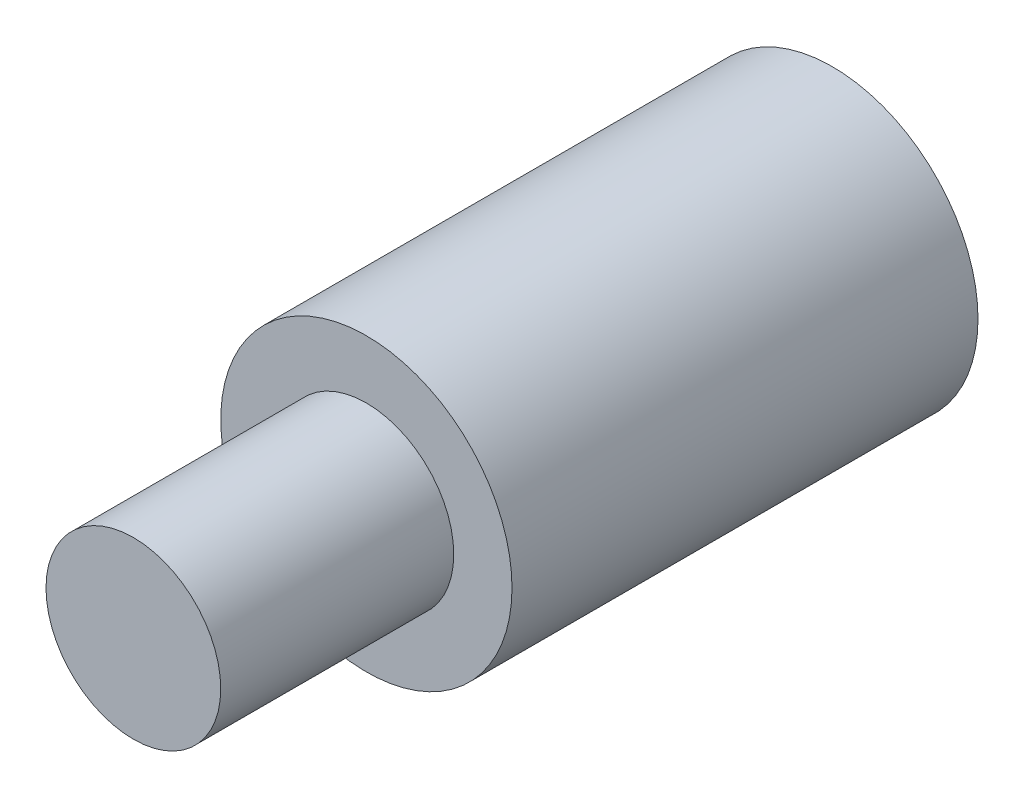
ISO-10303-21;
HEADER;
FILE_DESCRIPTION(('STEP AP214'),'2;1');
FILE_NAME('part.step','',(''),(''),'','','');
FILE_SCHEMA(('AUTOMOTIVE_DESIGN { 1 0 10303 214 1 1 1 1 }'));
ENDSEC;
DATA;
#1=APPLICATION_CONTEXT('core data for automotive mechanical design processes');
#2=APPLICATION_PROTOCOL_DEFINITION('international standard','automotive_design',2000,#1);
#3=PRODUCT_CONTEXT('',#1,'mechanical');
#4=PRODUCT('Part','Part','',(#3));
#5=PRODUCT_RELATED_PRODUCT_CATEGORY('part','',(#4));
#6=PRODUCT_DEFINITION_FORMATION('','',#4);
#7=PRODUCT_DEFINITION_CONTEXT('part definition',#1,'design');
#8=PRODUCT_DEFINITION('design','',#6,#7);
#9=PRODUCT_DEFINITION_SHAPE('','',#8);
#10=(LENGTH_UNIT() NAMED_UNIT(*) SI_UNIT(.MILLI.,.METRE.));
#11=(NAMED_UNIT(*) PLANE_ANGLE_UNIT() SI_UNIT($,.RADIAN.));
#12=(NAMED_UNIT(*) SI_UNIT($,.STERADIAN.) SOLID_ANGLE_UNIT());
#13=UNCERTAINTY_MEASURE_WITH_UNIT(LENGTH_MEASURE(1.E-05),#10,'distance_accuracy_value','');
#14=(GEOMETRIC_REPRESENTATION_CONTEXT(3) GLOBAL_UNCERTAINTY_ASSIGNED_CONTEXT((#13)) GLOBAL_UNIT_ASSIGNED_CONTEXT((#10,
#11,#12)) REPRESENTATION_CONTEXT('',''));
#15=CARTESIAN_POINT('',(0.,0.,0.));
#16=DIRECTION('',(0.,0.,1.));
#17=DIRECTION('',(1.,0.,0.));
#18=AXIS2_PLACEMENT_3D('',#15,#16,#17);
#19=CARTESIAN_POINT('',(0.,0.,8.));
#20=DIRECTION('',(0.,0.,1.));
#21=DIRECTION('',(1.,0.,0.));
#22=AXIS2_PLACEMENT_3D('',#19,#20,#21);
#23=PLANE('',#22);
#24=CARTESIAN_POINT('',(0.,0.,8.));
#25=DIRECTION('',(0.,0.,1.));
#26=DIRECTION('',(1.,0.,0.));
#27=AXIS2_PLACEMENT_3D('',#24,#25,#26);
#28=CIRCLE('',#27,2.5);
#29=CARTESIAN_POINT('',(2.5,0.,8.));
#30=VERTEX_POINT('',#29);
#31=EDGE_CURVE('E11',#30,#30,#28,.T.);
#32=ORIENTED_EDGE('',*,*,#31,.T.);
#33=EDGE_LOOP('',(#32));
#34=FACE_BOUND('',#33,.T.);
#35=CARTESIAN_POINT('',(0.,0.,8.));
#36=DIRECTION('',(0.,0.,1.));
#37=DIRECTION('',(1.,0.,0.));
#38=AXIS2_PLACEMENT_3D('',#35,#36,#37);
#39=CIRCLE('',#38,1.5);
#40=CARTESIAN_POINT('',(1.5,0.,8.));
#41=VERTEX_POINT('',#40);
#42=EDGE_CURVE('E50',#41,#41,#39,.T.);
#43=ORIENTED_EDGE('',*,*,#42,.F.);
#44=EDGE_LOOP('',(#43));
#45=FACE_BOUND('',#44,.T.);
#46=ADVANCED_FACE('F28',(#34,#45),#23,.T.);
#47=CARTESIAN_POINT('',(0.,0.,8.));
#48=DIRECTION('',(0.,0.,-1.));
#49=DIRECTION('',(-1.,0.,0.));
#50=AXIS2_PLACEMENT_3D('',#47,#48,#49);
#51=CYLINDRICAL_SURFACE('',#50,2.5);
#52=ORIENTED_EDGE('',*,*,#31,.F.);
#53=EDGE_LOOP('',(#52));
#54=FACE_BOUND('',#53,.T.);
#55=CARTESIAN_POINT('',(0.,0.,0.));
#56=DIRECTION('',(0.,0.,1.));
#57=DIRECTION('',(1.,0.,0.));
#58=AXIS2_PLACEMENT_3D('',#55,#56,#57);
#59=CIRCLE('',#58,2.5);
#60=CARTESIAN_POINT('',(2.5,0.,0.));
#61=VERTEX_POINT('',#60);
#62=EDGE_CURVE('E35',#61,#61,#59,.T.);
#63=ORIENTED_EDGE('',*,*,#62,.T.);
#64=EDGE_LOOP('',(#63));
#65=FACE_BOUND('',#64,.T.);
#66=ADVANCED_FACE('F30',(#54,#65),#51,.T.);
#67=CARTESIAN_POINT('',(0.,0.,0.));
#68=DIRECTION('',(0.,0.,1.));
#69=DIRECTION('',(1.,0.,0.));
#70=AXIS2_PLACEMENT_3D('',#67,#68,#69);
#71=PLANE('',#70);
#72=CARTESIAN_POINT('',(0.,0.,0.));
#73=DIRECTION('',(0.,0.,-1.));
#74=DIRECTION('',(-1.,0.,0.));
#75=AXIS2_PLACEMENT_3D('',#72,#73,#74);
#76=CIRCLE('',#75,1.25);
#77=CARTESIAN_POINT('',(-1.25,0.,0.));
#78=VERTEX_POINT('',#77);
#79=EDGE_CURVE('E47',#78,#78,#76,.T.);
#80=ORIENTED_EDGE('',*,*,#79,.F.);
#81=EDGE_LOOP('',(#80));
#82=FACE_BOUND('',#81,.T.);
#83=ORIENTED_EDGE('',*,*,#62,.F.);
#84=EDGE_LOOP('',(#83));
#85=FACE_BOUND('',#84,.T.);
#86=ADVANCED_FACE('F61',(#82,#85),#71,.F.);
#87=CARTESIAN_POINT('',(0.,0.,12.));
#88=DIRECTION('',(0.,0.,-1.));
#89=DIRECTION('',(-1.,0.,0.));
#90=AXIS2_PLACEMENT_3D('',#87,#88,#89);
#91=CYLINDRICAL_SURFACE('',#90,1.5);
#92=CARTESIAN_POINT('',(0.,0.,12.));
#93=DIRECTION('',(0.,0.,1.));
#94=DIRECTION('',(1.,0.,0.));
#95=AXIS2_PLACEMENT_3D('',#92,#93,#94);
#96=CIRCLE('',#95,1.5);
#97=CARTESIAN_POINT('',(1.5,0.,12.));
#98=VERTEX_POINT('',#97);
#99=EDGE_CURVE('E55',#98,#98,#96,.T.);
#100=ORIENTED_EDGE('',*,*,#99,.F.);
#101=EDGE_LOOP('',(#100));
#102=FACE_BOUND('',#101,.T.);
#103=ORIENTED_EDGE('',*,*,#42,.T.);
#104=EDGE_LOOP('',(#103));
#105=FACE_BOUND('',#104,.T.);
#106=ADVANCED_FACE('F63',(#102,#105),#91,.T.);
#107=CARTESIAN_POINT('',(0.,0.,12.));
#108=DIRECTION('',(0.,0.,1.));
#109=DIRECTION('',(1.,0.,0.));
#110=AXIS2_PLACEMENT_3D('',#107,#108,#109);
#111=PLANE('',#110);
#112=ORIENTED_EDGE('',*,*,#99,.T.);
#113=EDGE_LOOP('',(#112));
#114=FACE_BOUND('',#113,.T.);
#115=ADVANCED_FACE('F71',(#114),#111,.T.);
#116=CARTESIAN_POINT('',(0.,0.,0.));
#117=DIRECTION('',(0.,0.,-1.));
#118=DIRECTION('',(-1.,0.,0.));
#119=AXIS2_PLACEMENT_3D('',#116,#117,#118);
#120=CYLINDRICAL_SURFACE('',#119,1.25);
#121=CARTESIAN_POINT('',(0.,0.,7.5));
#122=DIRECTION('',(0.,0.,-1.));
#123=DIRECTION('',(-1.,0.,0.));
#124=AXIS2_PLACEMENT_3D('',#121,#122,#123);
#125=CIRCLE('',#124,1.25);
#126=CARTESIAN_POINT('',(-1.25,0.,7.5));
#127=VERTEX_POINT('',#126);
#128=EDGE_CURVE('E45',#127,#127,#125,.T.);
#129=ORIENTED_EDGE('',*,*,#128,.F.);
#130=EDGE_LOOP('',(#129));
#131=FACE_BOUND('',#130,.T.);
#132=ORIENTED_EDGE('',*,*,#79,.T.);
#133=EDGE_LOOP('',(#132));
#134=FACE_BOUND('',#133,.T.);
#135=ADVANCED_FACE('F41',(#131,#134),#120,.F.);
#136=CARTESIAN_POINT('',(0.,0.,7.5));
#137=DIRECTION('',(0.,0.,-1.));
#138=DIRECTION('',(-1.,0.,0.));
#139=AXIS2_PLACEMENT_3D('',#136,#137,#138);
#140=CONICAL_SURFACE('',#139,1.25,1.02974425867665);
#141=CARTESIAN_POINT('',(0.,0.,8.25107577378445));
#142=VERTEX_POINT('',#141);
#143=VERTEX_LOOP('',#142);
#144=FACE_BOUND('',#143,.T.);
#145=ORIENTED_EDGE('',*,*,#128,.T.);
#146=EDGE_LOOP('',(#145));
#147=FACE_BOUND('',#146,.T.);
#148=ADVANCED_FACE('F38',(#144,#147),#140,.F.);
#149=CLOSED_SHELL('',(#46,#66,#86,#106,#115,#135,#148));
#150=MANIFOLD_SOLID_BREP('B2',#149);
#151=ADVANCED_BREP_SHAPE_REPRESENTATION('',(#18,#150),#14);
#152=SHAPE_DEFINITION_REPRESENTATION(#9,#151);
ENDSEC;
END-ISO-10303-21;
